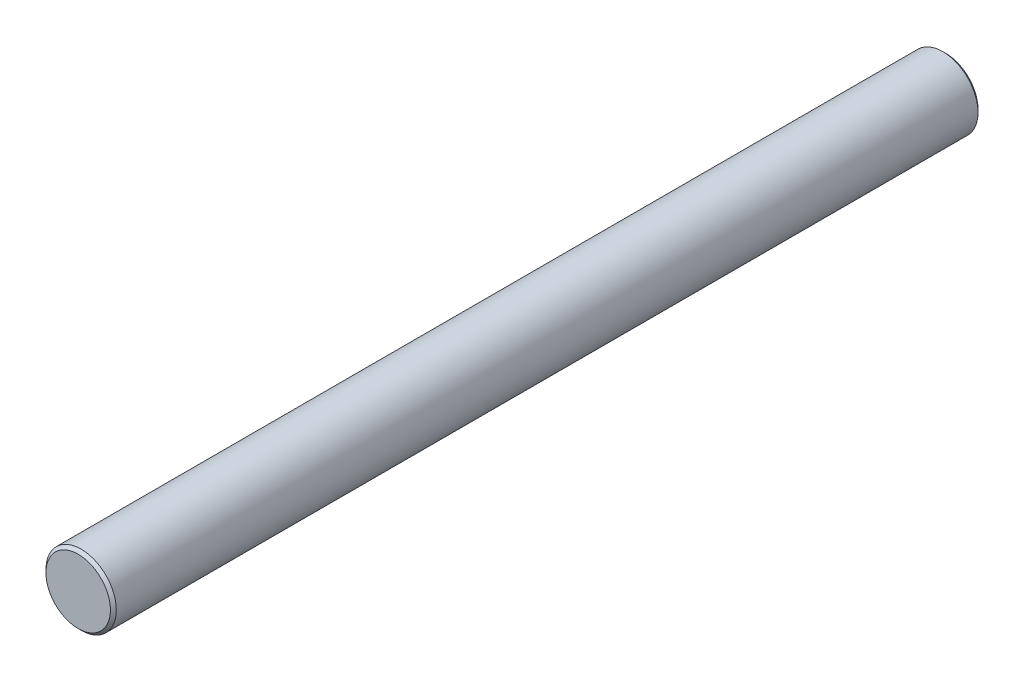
from build123d import *

# Parameters (mm, degrees)
SKETCH_1_R      = 3
EXTRUDE_1_DEPTH = 74
CHAMFER_1_SIZE  = 0.25


with BuildPart() as part:
    # Sketch 1 → Extrude 1 (new body)
    with BuildSketch(Plane.XY):
        Circle(SKETCH_1_R)
    extrude(amount=EXTRUDE_1_DEPTH)

    # Chamfer 1
    chamfer_1_edges = [part.edges().sort_by_distance(p)[0] for p in [
        (-3, 0, 0),
        (-3, 0, 74),
    ]]
    chamfer(chamfer_1_edges, length=CHAMFER_1_SIZE)


solid = part.part
